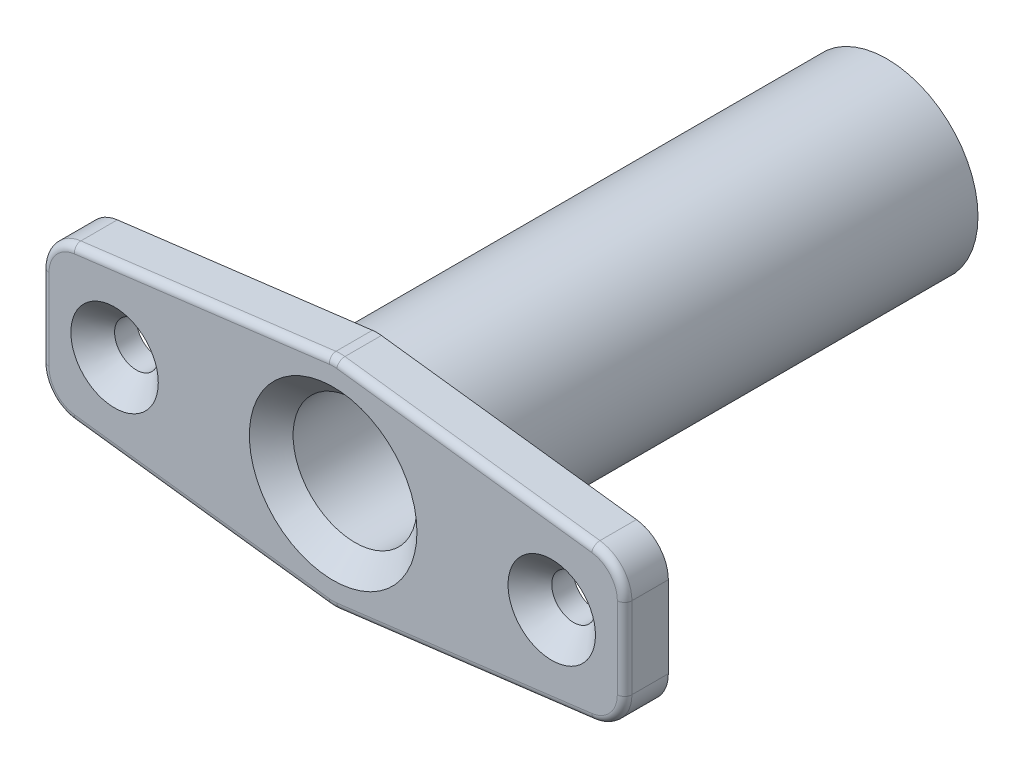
ISO-10303-21;
HEADER;
FILE_DESCRIPTION(('STEP AP214'),'2;1');
FILE_NAME('part.step','',(''),(''),'','','');
FILE_SCHEMA(('AUTOMOTIVE_DESIGN { 1 0 10303 214 1 1 1 1 }'));
ENDSEC;
DATA;
#1=APPLICATION_CONTEXT('core data for automotive mechanical design processes');
#2=APPLICATION_PROTOCOL_DEFINITION('international standard','automotive_design',2000,#1);
#3=PRODUCT_CONTEXT('',#1,'mechanical');
#4=PRODUCT('Part','Part','',(#3));
#5=PRODUCT_RELATED_PRODUCT_CATEGORY('part','',(#4));
#6=PRODUCT_DEFINITION_FORMATION('','',#4);
#7=PRODUCT_DEFINITION_CONTEXT('part definition',#1,'design');
#8=PRODUCT_DEFINITION('design','',#6,#7);
#9=PRODUCT_DEFINITION_SHAPE('','',#8);
#10=(LENGTH_UNIT() NAMED_UNIT(*) SI_UNIT(.MILLI.,.METRE.));
#11=(NAMED_UNIT(*) PLANE_ANGLE_UNIT() SI_UNIT($,.RADIAN.));
#12=(NAMED_UNIT(*) SI_UNIT($,.STERADIAN.) SOLID_ANGLE_UNIT());
#13=UNCERTAINTY_MEASURE_WITH_UNIT(LENGTH_MEASURE(1.E-05),#10,'distance_accuracy_value','');
#14=(GEOMETRIC_REPRESENTATION_CONTEXT(3) GLOBAL_UNCERTAINTY_ASSIGNED_CONTEXT((#13)) GLOBAL_UNIT_ASSIGNED_CONTEXT((#10,
#11,#12)) REPRESENTATION_CONTEXT('',''));
#15=CARTESIAN_POINT('',(0.,0.,0.));
#16=DIRECTION('',(0.,0.,1.));
#17=DIRECTION('',(1.,0.,0.));
#18=AXIS2_PLACEMENT_3D('',#15,#16,#17);
#19=CARTESIAN_POINT('',(0.,0.,4.));
#20=DIRECTION('',(0.,0.,1.));
#21=DIRECTION('',(1.,0.,0.));
#22=AXIS2_PLACEMENT_3D('',#19,#20,#21);
#23=PLANE('',#22);
#24=CARTESIAN_POINT('',(0.,0.,4.));
#25=DIRECTION('',(0.,0.,1.));
#26=DIRECTION('',(1.,0.,0.));
#27=AXIS2_PLACEMENT_3D('',#24,#25,#26);
#28=CIRCLE('',#27,8.5);
#29=CARTESIAN_POINT('',(8.5,0.,4.));
#30=VERTEX_POINT('',#29);
#31=EDGE_CURVE('E192',#30,#30,#28,.T.);
#32=ORIENTED_EDGE('',*,*,#31,.T.);
#33=EDGE_LOOP('',(#32));
#34=FACE_BOUND('',#33,.T.);
#35=ADVANCED_FACE('F24',(#34),#23,.T.);
#36=CARTESIAN_POINT('',(0.,0.,4.));
#37=DIRECTION('',(0.,0.,1.));
#38=DIRECTION('',(1.,0.,0.));
#39=AXIS2_PLACEMENT_3D('',#36,#37,#38);
#40=CYLINDRICAL_SURFACE('',#39,8.5);
#41=CARTESIAN_POINT('',(0.,0.,73.));
#42=DIRECTION('',(0.,0.,1.));
#43=DIRECTION('',(1.,0.,0.));
#44=AXIS2_PLACEMENT_3D('',#41,#42,#43);
#45=CIRCLE('',#44,8.5);
#46=CARTESIAN_POINT('',(8.5,0.,73.));
#47=VERTEX_POINT('',#46);
#48=EDGE_CURVE('E234',#47,#47,#45,.T.);
#49=ORIENTED_EDGE('',*,*,#48,.T.);
#50=EDGE_LOOP('',(#49));
#51=FACE_BOUND('',#50,.T.);
#52=ORIENTED_EDGE('',*,*,#31,.F.);
#53=EDGE_LOOP('',(#52));
#54=FACE_BOUND('',#53,.T.);
#55=ADVANCED_FACE('F375',(#51,#54),#40,.F.);
#56=CARTESIAN_POINT('',(0.,0.,70.));
#57=DIRECTION('',(0.,0.,-1.));
#58=DIRECTION('',(-1.,0.,0.));
#59=AXIS2_PLACEMENT_3D('',#56,#57,#58);
#60=CYLINDRICAL_SURFACE('',#59,12.5);
#61=CARTESIAN_POINT('',(0.,0.,70.));
#62=DIRECTION('',(0.,0.,1.));
#63=DIRECTION('',(1.,0.,0.));
#64=AXIS2_PLACEMENT_3D('',#61,#62,#63);
#65=CIRCLE('',#64,12.5);
#66=CARTESIAN_POINT('',(12.5,0.,70.));
#67=VERTEX_POINT('',#66);
#68=EDGE_CURVE('E198',#67,#67,#65,.T.);
#69=ORIENTED_EDGE('',*,*,#68,.F.);
#70=EDGE_LOOP('',(#69));
#71=FACE_BOUND('',#70,.T.);
#72=CARTESIAN_POINT('',(0.,0.,0.));
#73=DIRECTION('',(0.,0.,1.));
#74=DIRECTION('',(1.,0.,0.));
#75=AXIS2_PLACEMENT_3D('',#72,#73,#74);
#76=CIRCLE('',#75,12.5);
#77=CARTESIAN_POINT('',(12.5,0.,0.));
#78=VERTEX_POINT('',#77);
#79=EDGE_CURVE('E195',#78,#78,#76,.T.);
#80=ORIENTED_EDGE('',*,*,#79,.T.);
#81=EDGE_LOOP('',(#80));
#82=FACE_BOUND('',#81,.T.);
#83=ADVANCED_FACE('F26',(#71,#82),#60,.T.);
#84=CARTESIAN_POINT('',(0.,0.,0.));
#85=DIRECTION('',(0.,0.,1.));
#86=DIRECTION('',(1.,0.,0.));
#87=AXIS2_PLACEMENT_3D('',#84,#85,#86);
#88=PLANE('',#87);
#89=ORIENTED_EDGE('',*,*,#79,.F.);
#90=EDGE_LOOP('',(#89));
#91=FACE_BOUND('',#90,.T.);
#92=ADVANCED_FACE('F385',(#91),#88,.F.);
#93=CARTESIAN_POINT('',(40.,10.,70.));
#94=DIRECTION('',(0.,0.,1.));
#95=DIRECTION('',(1.,0.,0.));
#96=AXIS2_PLACEMENT_3D('',#93,#94,#95);
#97=PLANE('',#96);
#98=CARTESIAN_POINT('',(30.,0.,70.));
#99=DIRECTION('',(0.,0.,1.));
#100=DIRECTION('',(1.,0.,0.));
#101=AXIS2_PLACEMENT_3D('',#98,#99,#100);
#102=CIRCLE('',#101,3.);
#103=CARTESIAN_POINT('',(33.,0.,70.));
#104=VERTEX_POINT('',#103);
#105=EDGE_CURVE('E352',#104,#104,#102,.T.);
#106=ORIENTED_EDGE('',*,*,#105,.T.);
#107=EDGE_LOOP('',(#106));
#108=FACE_BOUND('',#107,.T.);
#109=CARTESIAN_POINT('',(-30.,0.,70.));
#110=DIRECTION('',(0.,0.,1.));
#111=DIRECTION('',(1.,0.,0.));
#112=AXIS2_PLACEMENT_3D('',#109,#110,#111);
#113=CIRCLE('',#112,3.);
#114=CARTESIAN_POINT('',(-27.,0.,70.));
#115=VERTEX_POINT('',#114);
#116=EDGE_CURVE('E181',#115,#115,#113,.T.);
#117=ORIENTED_EDGE('',*,*,#116,.T.);
#118=EDGE_LOOP('',(#117));
#119=FACE_BOUND('',#118,.T.);
#120=DIRECTION('',(0.992277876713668,0.124034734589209,0.));
#121=VECTOR('',#120,1.);
#122=CARTESIAN_POINT('',(0.,-15.,70.));
#123=LINE('',#122,#121);
#124=CARTESIAN_POINT('',(0.620173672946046,-14.9224782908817,70.));
#125=VERTEX_POINT('',#124);
#126=CARTESIAN_POINT('',(35.6201736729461,-10.5474782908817,70.));
#127=VERTEX_POINT('',#126);
#128=EDGE_CURVE('E176',#125,#127,#123,.T.);
#129=ORIENTED_EDGE('',*,*,#128,.F.);
#130=CARTESIAN_POINT('',(0.,-9.96108890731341,70.));
#131=DIRECTION('',(0.,0.,1.));
#132=DIRECTION('',(1.,0.,0.));
#133=AXIS2_PLACEMENT_3D('',#130,#131,#132);
#134=CIRCLE('',#133,5.);
#135=CARTESIAN_POINT('',(-0.620173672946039,-14.9224782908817,70.));
#136=VERTEX_POINT('',#135);
#137=EDGE_CURVE('E229',#125,#136,#134,.F.);
#138=ORIENTED_EDGE('',*,*,#137,.T.);
#139=DIRECTION('',(-0.992277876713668,0.124034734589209,0.));
#140=VECTOR('',#139,1.);
#141=CARTESIAN_POINT('',(0.,-15.,70.));
#142=LINE('',#141,#140);
#143=CARTESIAN_POINT('',(-35.6201736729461,-10.5474782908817,70.));
#144=VERTEX_POINT('',#143);
#145=EDGE_CURVE('E179',#136,#144,#142,.T.);
#146=ORIENTED_EDGE('',*,*,#145,.T.);
#147=CARTESIAN_POINT('',(-35.,-5.58608890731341,70.));
#148=DIRECTION('',(0.,0.,1.));
#149=DIRECTION('',(1.,0.,0.));
#150=AXIS2_PLACEMENT_3D('',#147,#148,#149);
#151=CIRCLE('',#150,5.);
#152=CARTESIAN_POINT('',(-40.,-5.58608890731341,70.));
#153=VERTEX_POINT('',#152);
#154=EDGE_CURVE('E210',#144,#153,#151,.F.);
#155=ORIENTED_EDGE('',*,*,#154,.T.);
#156=DIRECTION('',(0.,-1.,0.));
#157=VECTOR('',#156,1.);
#158=CARTESIAN_POINT('',(-40.,10.,70.));
#159=LINE('',#158,#157);
#160=CARTESIAN_POINT('',(-40.,5.58608890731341,70.));
#161=VERTEX_POINT('',#160);
#162=EDGE_CURVE('E187',#161,#153,#159,.T.);
#163=ORIENTED_EDGE('',*,*,#162,.F.);
#164=CARTESIAN_POINT('',(-35.,5.58608890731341,70.));
#165=DIRECTION('',(0.,0.,1.));
#166=DIRECTION('',(1.,0.,0.));
#167=AXIS2_PLACEMENT_3D('',#164,#165,#166);
#168=CIRCLE('',#167,5.);
#169=CARTESIAN_POINT('',(-35.6201736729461,10.5474782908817,70.));
#170=VERTEX_POINT('',#169);
#171=EDGE_CURVE('E212',#161,#170,#168,.F.);
#172=ORIENTED_EDGE('',*,*,#171,.T.);
#173=DIRECTION('',(-0.992277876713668,-0.124034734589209,0.));
#174=VECTOR('',#173,1.);
#175=CARTESIAN_POINT('',(0.,15.,70.));
#176=LINE('',#175,#174);
#177=CARTESIAN_POINT('',(-0.62017367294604,14.9224782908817,70.));
#178=VERTEX_POINT('',#177);
#179=EDGE_CURVE('E190',#178,#170,#176,.T.);
#180=ORIENTED_EDGE('',*,*,#179,.F.);
#181=CARTESIAN_POINT('',(0.,9.96108890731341,70.));
#182=DIRECTION('',(0.,0.,1.));
#183=DIRECTION('',(1.,0.,0.));
#184=AXIS2_PLACEMENT_3D('',#181,#182,#183);
#185=CIRCLE('',#184,5.);
#186=CARTESIAN_POINT('',(0.620173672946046,14.9224782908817,70.));
#187=VERTEX_POINT('',#186);
#188=EDGE_CURVE('E222',#178,#187,#185,.F.);
#189=ORIENTED_EDGE('',*,*,#188,.T.);
#190=DIRECTION('',(0.992277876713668,-0.124034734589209,0.));
#191=VECTOR('',#190,1.);
#192=CARTESIAN_POINT('',(0.,15.,70.));
#193=LINE('',#192,#191);
#194=CARTESIAN_POINT('',(35.6201736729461,10.5474782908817,70.));
#195=VERTEX_POINT('',#194);
#196=EDGE_CURVE('E177',#187,#195,#193,.T.);
#197=ORIENTED_EDGE('',*,*,#196,.T.);
#198=CARTESIAN_POINT('',(35.,5.58608890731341,70.));
#199=DIRECTION('',(0.,0.,1.));
#200=DIRECTION('',(1.,0.,0.));
#201=AXIS2_PLACEMENT_3D('',#198,#199,#200);
#202=CIRCLE('',#201,5.);
#203=CARTESIAN_POINT('',(40.,5.58608890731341,70.));
#204=VERTEX_POINT('',#203);
#205=EDGE_CURVE('E160',#195,#204,#202,.F.);
#206=ORIENTED_EDGE('',*,*,#205,.T.);
#207=DIRECTION('',(0.,1.,0.));
#208=VECTOR('',#207,1.);
#209=CARTESIAN_POINT('',(40.,-10.,70.));
#210=LINE('',#209,#208);
#211=CARTESIAN_POINT('',(40.,-5.58608890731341,70.));
#212=VERTEX_POINT('',#211);
#213=EDGE_CURVE('E154',#212,#204,#210,.T.);
#214=ORIENTED_EDGE('',*,*,#213,.F.);
#215=CARTESIAN_POINT('',(35.,-5.58608890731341,70.));
#216=DIRECTION('',(0.,0.,1.));
#217=DIRECTION('',(1.,0.,0.));
#218=AXIS2_PLACEMENT_3D('',#215,#216,#217);
#219=CIRCLE('',#218,5.);
#220=EDGE_CURVE('E165',#212,#127,#219,.F.);
#221=ORIENTED_EDGE('',*,*,#220,.T.);
#222=EDGE_LOOP('',(#129,#138,#146,#155,#163,#172,#180,#189,#197,#206,#214,#221));
#223=FACE_BOUND('',#222,.T.);
#224=ORIENTED_EDGE('',*,*,#68,.T.);
#225=EDGE_LOOP('',(#224));
#226=FACE_BOUND('',#225,.T.);
#227=ADVANCED_FACE('F172',(#108,#119,#223,#226),#97,.F.);
#228=CARTESIAN_POINT('',(0.,15.,76.));
#229=DIRECTION('',(0.124034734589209,0.992277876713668,0.));
#230=DIRECTION('',(-0.992277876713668,0.124034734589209,0.));
#231=AXIS2_PLACEMENT_3D('',#228,#229,#230);
#232=PLANE('',#231);
#233=DIRECTION('',(0.,0.,-1.));
#234=VECTOR('',#233,1.);
#235=CARTESIAN_POINT('',(0.620173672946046,14.9224782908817,76.));
#236=LINE('',#235,#234);
#237=CARTESIAN_POINT('',(0.620173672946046,14.9224782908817,75.));
#238=VERTEX_POINT('',#237);
#239=EDGE_CURVE('E224',#187,#238,#236,.F.);
#240=ORIENTED_EDGE('',*,*,#239,.T.);
#241=DIRECTION('',(0.992277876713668,-0.124034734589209,0.));
#242=VECTOR('',#241,1.);
#243=CARTESIAN_POINT('',(0.,15.,75.));
#244=LINE('',#243,#242);
#245=CARTESIAN_POINT('',(35.620173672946,10.5474782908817,75.));
#246=VERTEX_POINT('',#245);
#247=EDGE_CURVE('E284',#238,#246,#244,.T.);
#248=ORIENTED_EDGE('',*,*,#247,.T.);
#249=DIRECTION('',(0.,0.,-1.));
#250=VECTOR('',#249,1.);
#251=CARTESIAN_POINT('',(35.620173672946,10.5474782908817,76.));
#252=LINE('',#251,#250);
#253=EDGE_CURVE('E204',#246,#195,#252,.T.);
#254=ORIENTED_EDGE('',*,*,#253,.T.);
#255=ORIENTED_EDGE('',*,*,#196,.F.);
#256=EDGE_LOOP('',(#240,#248,#254,#255));
#257=FACE_BOUND('',#256,.T.);
#258=ADVANCED_FACE('F392',(#257),#232,.T.);
#259=CARTESIAN_POINT('',(0.,15.,76.));
#260=DIRECTION('',(0.124034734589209,-0.992277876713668,0.));
#261=DIRECTION('',(0.992277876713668,0.124034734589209,0.));
#262=AXIS2_PLACEMENT_3D('',#259,#260,#261);
#263=PLANE('',#262);
#264=DIRECTION('',(0.,0.,-1.));
#265=VECTOR('',#264,1.);
#266=CARTESIAN_POINT('',(-35.6201736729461,10.5474782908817,76.));
#267=LINE('',#266,#265);
#268=CARTESIAN_POINT('',(-35.6201736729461,10.5474782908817,75.));
#269=VERTEX_POINT('',#268);
#270=EDGE_CURVE('E215',#170,#269,#267,.F.);
#271=ORIENTED_EDGE('',*,*,#270,.T.);
#272=DIRECTION('',(-0.992277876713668,-0.124034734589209,0.));
#273=VECTOR('',#272,1.);
#274=CARTESIAN_POINT('',(38.7692307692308,19.8461538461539,75.));
#275=LINE('',#274,#273);
#276=CARTESIAN_POINT('',(-0.62017367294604,14.9224782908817,75.));
#277=VERTEX_POINT('',#276);
#278=EDGE_CURVE('E282',#269,#277,#275,.F.);
#279=ORIENTED_EDGE('',*,*,#278,.T.);
#280=DIRECTION('',(0.,0.,-1.));
#281=VECTOR('',#280,1.);
#282=CARTESIAN_POINT('',(-0.62017367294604,14.9224782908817,76.));
#283=LINE('',#282,#281);
#284=EDGE_CURVE('E220',#277,#178,#283,.T.);
#285=ORIENTED_EDGE('',*,*,#284,.T.);
#286=ORIENTED_EDGE('',*,*,#179,.T.);
#287=EDGE_LOOP('',(#271,#279,#285,#286));
#288=FACE_BOUND('',#287,.T.);
#289=ADVANCED_FACE('F305',(#288),#263,.F.);
#290=CARTESIAN_POINT('',(-40.,10.,76.));
#291=DIRECTION('',(1.,0.,0.));
#292=DIRECTION('',(0.,0.,-1.));
#293=AXIS2_PLACEMENT_3D('',#290,#291,#292);
#294=PLANE('',#293);
#295=DIRECTION('',(0.,0.,-1.));
#296=VECTOR('',#295,1.);
#297=CARTESIAN_POINT('',(-40.,-5.58608890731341,76.));
#298=LINE('',#297,#296);
#299=CARTESIAN_POINT('',(-40.,-5.58608890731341,75.));
#300=VERTEX_POINT('',#299);
#301=EDGE_CURVE('E206',#153,#300,#298,.F.);
#302=ORIENTED_EDGE('',*,*,#301,.T.);
#303=DIRECTION('',(0.,-1.,0.));
#304=VECTOR('',#303,1.);
#305=CARTESIAN_POINT('',(-40.,10.,75.));
#306=LINE('',#305,#304);
#307=CARTESIAN_POINT('',(-40.,5.58608890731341,75.));
#308=VERTEX_POINT('',#307);
#309=EDGE_CURVE('E45',#300,#308,#306,.F.);
#310=ORIENTED_EDGE('',*,*,#309,.T.);
#311=DIRECTION('',(0.,0.,-1.));
#312=VECTOR('',#311,1.);
#313=CARTESIAN_POINT('',(-40.,5.58608890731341,76.));
#314=LINE('',#313,#312);
#315=EDGE_CURVE('E208',#308,#161,#314,.T.);
#316=ORIENTED_EDGE('',*,*,#315,.T.);
#317=ORIENTED_EDGE('',*,*,#162,.T.);
#318=EDGE_LOOP('',(#302,#310,#316,#317));
#319=FACE_BOUND('',#318,.T.);
#320=ADVANCED_FACE('F611',(#319),#294,.F.);
#321=CARTESIAN_POINT('',(0.,-15.,76.));
#322=DIRECTION('',(-0.124034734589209,-0.992277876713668,0.));
#323=DIRECTION('',(0.992277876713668,-0.124034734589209,0.));
#324=AXIS2_PLACEMENT_3D('',#321,#322,#323);
#325=PLANE('',#324);
#326=DIRECTION('',(0.,0.,-1.));
#327=VECTOR('',#326,1.);
#328=CARTESIAN_POINT('',(-0.620173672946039,-14.9224782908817,76.));
#329=LINE('',#328,#327);
#330=CARTESIAN_POINT('',(-0.620173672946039,-14.9224782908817,75.));
#331=VERTEX_POINT('',#330);
#332=EDGE_CURVE('E231',#136,#331,#329,.F.);
#333=ORIENTED_EDGE('',*,*,#332,.T.);
#334=DIRECTION('',(-0.992277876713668,0.124034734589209,0.));
#335=VECTOR('',#334,1.);
#336=CARTESIAN_POINT('',(0.,-15.,75.));
#337=LINE('',#336,#335);
#338=CARTESIAN_POINT('',(-35.620173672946,-10.5474782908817,75.));
#339=VERTEX_POINT('',#338);
#340=EDGE_CURVE('E289',#331,#339,#337,.T.);
#341=ORIENTED_EDGE('',*,*,#340,.T.);
#342=DIRECTION('',(0.,0.,-1.));
#343=VECTOR('',#342,1.);
#344=CARTESIAN_POINT('',(-35.620173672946,-10.5474782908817,76.));
#345=LINE('',#344,#343);
#346=EDGE_CURVE('E218',#339,#144,#345,.T.);
#347=ORIENTED_EDGE('',*,*,#346,.T.);
#348=ORIENTED_EDGE('',*,*,#145,.F.);
#349=EDGE_LOOP('',(#333,#341,#347,#348));
#350=FACE_BOUND('',#349,.T.);
#351=ADVANCED_FACE('F606',(#350),#325,.T.);
#352=CARTESIAN_POINT('',(0.,-15.,76.));
#353=DIRECTION('',(-0.124034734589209,0.992277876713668,0.));
#354=DIRECTION('',(-0.992277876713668,-0.124034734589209,0.));
#355=AXIS2_PLACEMENT_3D('',#352,#353,#354);
#356=PLANE('',#355);
#357=DIRECTION('',(0.,0.,-1.));
#358=VECTOR('',#357,1.);
#359=CARTESIAN_POINT('',(35.6201736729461,-10.5474782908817,76.));
#360=LINE('',#359,#358);
#361=CARTESIAN_POINT('',(35.6201736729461,-10.5474782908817,75.));
#362=VERTEX_POINT('',#361);
#363=EDGE_CURVE('E168',#127,#362,#360,.F.);
#364=ORIENTED_EDGE('',*,*,#363,.T.);
#365=DIRECTION('',(0.992277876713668,0.124034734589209,0.));
#366=VECTOR('',#365,1.);
#367=CARTESIAN_POINT('',(42.4615384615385,-9.69230769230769,75.));
#368=LINE('',#367,#366);
#369=CARTESIAN_POINT('',(0.620173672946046,-14.9224782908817,75.));
#370=VERTEX_POINT('',#369);
#371=EDGE_CURVE('E287',#362,#370,#368,.F.);
#372=ORIENTED_EDGE('',*,*,#371,.T.);
#373=DIRECTION('',(0.,0.,-1.));
#374=VECTOR('',#373,1.);
#375=CARTESIAN_POINT('',(0.620173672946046,-14.9224782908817,76.));
#376=LINE('',#375,#374);
#377=EDGE_CURVE('E227',#370,#125,#376,.T.);
#378=ORIENTED_EDGE('',*,*,#377,.T.);
#379=ORIENTED_EDGE('',*,*,#128,.T.);
#380=EDGE_LOOP('',(#364,#372,#378,#379));
#381=FACE_BOUND('',#380,.T.);
#382=ADVANCED_FACE('F595',(#381),#356,.F.);
#383=CARTESIAN_POINT('',(40.,-10.,76.));
#384=DIRECTION('',(-1.,0.,0.));
#385=DIRECTION('',(0.,0.,1.));
#386=AXIS2_PLACEMENT_3D('',#383,#384,#385);
#387=PLANE('',#386);
#388=DIRECTION('',(0.,0.,-1.));
#389=VECTOR('',#388,1.);
#390=CARTESIAN_POINT('',(40.,5.58608890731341,76.));
#391=LINE('',#390,#389);
#392=CARTESIAN_POINT('',(40.,5.58608890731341,75.));
#393=VERTEX_POINT('',#392);
#394=EDGE_CURVE('E161',#204,#393,#391,.F.);
#395=ORIENTED_EDGE('',*,*,#394,.T.);
#396=DIRECTION('',(0.,1.,0.));
#397=VECTOR('',#396,1.);
#398=CARTESIAN_POINT('',(40.,10.,75.));
#399=LINE('',#398,#397);
#400=CARTESIAN_POINT('',(40.,-5.58608890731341,75.));
#401=VERTEX_POINT('',#400);
#402=EDGE_CURVE('E157',#393,#401,#399,.F.);
#403=ORIENTED_EDGE('',*,*,#402,.T.);
#404=DIRECTION('',(0.,0.,-1.));
#405=VECTOR('',#404,1.);
#406=CARTESIAN_POINT('',(40.,-5.58608890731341,76.));
#407=LINE('',#406,#405);
#408=EDGE_CURVE('E149',#401,#212,#407,.T.);
#409=ORIENTED_EDGE('',*,*,#408,.T.);
#410=ORIENTED_EDGE('',*,*,#213,.T.);
#411=EDGE_LOOP('',(#395,#403,#409,#410));
#412=FACE_BOUND('',#411,.T.);
#413=ADVANCED_FACE('F152',(#412),#387,.F.);
#414=CARTESIAN_POINT('',(40.,10.,76.));
#415=DIRECTION('',(0.,0.,1.));
#416=DIRECTION('',(1.,0.,0.));
#417=AXIS2_PLACEMENT_3D('',#414,#415,#416);
#418=PLANE('',#417);
#419=CARTESIAN_POINT('',(0.,9.96108890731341,76.));
#420=DIRECTION('',(0.,0.,1.));
#421=DIRECTION('',(1.,0.,0.));
#422=AXIS2_PLACEMENT_3D('',#419,#420,#421);
#423=CIRCLE('',#422,4.);
#424=CARTESIAN_POINT('',(0.496138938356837,13.9302004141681,76.));
#425=VERTEX_POINT('',#424);
#426=CARTESIAN_POINT('',(-0.496138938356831,13.9302004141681,76.));
#427=VERTEX_POINT('',#426);
#428=EDGE_CURVE('E266',#425,#427,#423,.T.);
#429=ORIENTED_EDGE('',*,*,#428,.T.);
#430=DIRECTION('',(-0.992277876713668,-0.124034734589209,0.));
#431=VECTOR('',#430,1.);
#432=CARTESIAN_POINT('',(38.89326550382,18.8538759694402,76.));
#433=LINE('',#432,#431);
#434=CARTESIAN_POINT('',(-35.4961389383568,9.55520041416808,76.));
#435=VERTEX_POINT('',#434);
#436=EDGE_CURVE('E275',#427,#435,#433,.T.);
#437=ORIENTED_EDGE('',*,*,#436,.T.);
#438=CARTESIAN_POINT('',(-35.,5.58608890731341,76.));
#439=DIRECTION('',(0.,0.,1.));
#440=DIRECTION('',(1.,0.,0.));
#441=AXIS2_PLACEMENT_3D('',#438,#439,#440);
#442=CIRCLE('',#441,4.);
#443=CARTESIAN_POINT('',(-39.,5.58608890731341,76.));
#444=VERTEX_POINT('',#443);
#445=EDGE_CURVE('E273',#435,#444,#442,.T.);
#446=ORIENTED_EDGE('',*,*,#445,.T.);
#447=DIRECTION('',(0.,-1.,0.));
#448=VECTOR('',#447,1.);
#449=CARTESIAN_POINT('',(-39.,10.,76.));
#450=LINE('',#449,#448);
#451=CARTESIAN_POINT('',(-39.,-5.58608890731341,76.));
#452=VERTEX_POINT('',#451);
#453=EDGE_CURVE('E271',#444,#452,#450,.T.);
#454=ORIENTED_EDGE('',*,*,#453,.T.);
#455=CARTESIAN_POINT('',(-35.,-5.58608890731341,76.));
#456=DIRECTION('',(0.,0.,1.));
#457=DIRECTION('',(1.,0.,0.));
#458=AXIS2_PLACEMENT_3D('',#455,#456,#457);
#459=CIRCLE('',#458,4.);
#460=CARTESIAN_POINT('',(-35.4961389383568,-9.55520041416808,76.));
#461=VERTEX_POINT('',#460);
#462=EDGE_CURVE('E269',#452,#461,#459,.T.);
#463=ORIENTED_EDGE('',*,*,#462,.T.);
#464=DIRECTION('',(-0.992277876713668,0.124034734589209,0.));
#465=VECTOR('',#464,1.);
#466=CARTESIAN_POINT('',(36.4317270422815,-18.5461836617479,76.));
#467=LINE('',#466,#465);
#468=CARTESIAN_POINT('',(-0.496138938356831,-13.9302004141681,76.));
#469=VERTEX_POINT('',#468);
#470=EDGE_CURVE('E262',#461,#469,#467,.F.);
#471=ORIENTED_EDGE('',*,*,#470,.T.);
#472=CARTESIAN_POINT('',(0.,-9.96108890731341,76.));
#473=DIRECTION('',(0.,0.,1.));
#474=DIRECTION('',(1.,0.,0.));
#475=AXIS2_PLACEMENT_3D('',#472,#473,#474);
#476=CIRCLE('',#475,4.);
#477=CARTESIAN_POINT('',(0.496138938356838,-13.9302004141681,76.));
#478=VERTEX_POINT('',#477);
#479=EDGE_CURVE('E258',#469,#478,#476,.T.);
#480=ORIENTED_EDGE('',*,*,#479,.T.);
#481=DIRECTION('',(0.992277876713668,0.124034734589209,0.));
#482=VECTOR('',#481,1.);
#483=CARTESIAN_POINT('',(42.3375037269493,-8.70002981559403,76.));
#484=LINE('',#483,#482);
#485=CARTESIAN_POINT('',(35.4961389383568,-9.55520041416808,76.));
#486=VERTEX_POINT('',#485);
#487=EDGE_CURVE('E254',#478,#486,#484,.T.);
#488=ORIENTED_EDGE('',*,*,#487,.T.);
#489=CARTESIAN_POINT('',(35.,-5.58608890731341,76.));
#490=DIRECTION('',(0.,0.,1.));
#491=DIRECTION('',(1.,0.,0.));
#492=AXIS2_PLACEMENT_3D('',#489,#490,#491);
#493=CIRCLE('',#492,4.);
#494=CARTESIAN_POINT('',(39.,-5.58608890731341,76.));
#495=VERTEX_POINT('',#494);
#496=EDGE_CURVE('E252',#486,#495,#493,.T.);
#497=ORIENTED_EDGE('',*,*,#496,.T.);
#498=DIRECTION('',(0.,1.,0.));
#499=VECTOR('',#498,1.);
#500=CARTESIAN_POINT('',(39.,10.,76.));
#501=LINE('',#500,#499);
#502=CARTESIAN_POINT('',(39.,5.58608890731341,76.));
#503=VERTEX_POINT('',#502);
#504=EDGE_CURVE('E256',#495,#503,#501,.T.);
#505=ORIENTED_EDGE('',*,*,#504,.T.);
#506=CARTESIAN_POINT('',(35.,5.58608890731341,76.));
#507=DIRECTION('',(0.,0.,1.));
#508=DIRECTION('',(1.,0.,0.));
#509=AXIS2_PLACEMENT_3D('',#506,#507,#508);
#510=CIRCLE('',#509,4.);
#511=CARTESIAN_POINT('',(35.4961389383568,9.55520041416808,76.));
#512=VERTEX_POINT('',#511);
#513=EDGE_CURVE('E260',#503,#512,#510,.T.);
#514=ORIENTED_EDGE('',*,*,#513,.T.);
#515=DIRECTION('',(0.992277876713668,-0.124034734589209,0.));
#516=VECTOR('',#515,1.);
#517=CARTESIAN_POINT('',(39.8759652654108,9.00772212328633,76.));
#518=LINE('',#517,#516);
#519=EDGE_CURVE('E264',#512,#425,#518,.F.);
#520=ORIENTED_EDGE('',*,*,#519,.T.);
#521=EDGE_LOOP('',(#429,#437,#446,#454,#463,#471,#480,#488,#497,#505,#514,#520));
#522=FACE_BOUND('',#521,.T.);
#523=CARTESIAN_POINT('',(30.,0.,76.));
#524=DIRECTION('',(0.,0.,1.));
#525=DIRECTION('',(1.,0.,0.));
#526=AXIS2_PLACEMENT_3D('',#523,#524,#525);
#527=CIRCLE('',#526,6.00000000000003);
#528=CARTESIAN_POINT('',(36.,0.,76.));
#529=VERTEX_POINT('',#528);
#530=EDGE_CURVE('E246',#529,#529,#527,.F.);
#531=ORIENTED_EDGE('',*,*,#530,.T.);
#532=EDGE_LOOP('',(#531));
#533=FACE_BOUND('',#532,.T.);
#534=CARTESIAN_POINT('',(-30.,0.,76.));
#535=DIRECTION('',(0.,0.,1.));
#536=DIRECTION('',(1.,0.,0.));
#537=AXIS2_PLACEMENT_3D('',#534,#535,#536);
#538=CIRCLE('',#537,6.00000000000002);
#539=CARTESIAN_POINT('',(-24.,0.,76.));
#540=VERTEX_POINT('',#539);
#541=EDGE_CURVE('E243',#540,#540,#538,.F.);
#542=ORIENTED_EDGE('',*,*,#541,.T.);
#543=EDGE_LOOP('',(#542));
#544=FACE_BOUND('',#543,.T.);
#545=CARTESIAN_POINT('',(0.,0.,76.));
#546=DIRECTION('',(0.,0.,1.));
#547=DIRECTION('',(1.,0.,0.));
#548=AXIS2_PLACEMENT_3D('',#545,#546,#547);
#549=CIRCLE('',#548,11.5);
#550=CARTESIAN_POINT('',(11.5,0.,76.));
#551=VERTEX_POINT('',#550);
#552=EDGE_CURVE('E237',#551,#551,#549,.F.);
#553=ORIENTED_EDGE('',*,*,#552,.T.);
#554=EDGE_LOOP('',(#553));
#555=FACE_BOUND('',#554,.T.);
#556=ADVANCED_FACE('F412',(#522,#533,#544,#555),#418,.T.);
#557=CARTESIAN_POINT('',(35.,-5.58608890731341,76.));
#558=DIRECTION('',(0.,0.,-1.));
#559=DIRECTION('',(-1.,0.,0.));
#560=AXIS2_PLACEMENT_3D('',#557,#558,#559);
#561=CYLINDRICAL_SURFACE('',#560,5.);
#562=ORIENTED_EDGE('',*,*,#408,.F.);
#563=CARTESIAN_POINT('',(35.,-5.58608890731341,75.));
#564=DIRECTION('',(0.,0.,1.));
#565=DIRECTION('',(1.,0.,0.));
#566=AXIS2_PLACEMENT_3D('',#563,#564,#565);
#567=CIRCLE('',#566,5.);
#568=EDGE_CURVE('E11',#401,#362,#567,.F.);
#569=ORIENTED_EDGE('',*,*,#568,.T.);
#570=ORIENTED_EDGE('',*,*,#363,.F.);
#571=ORIENTED_EDGE('',*,*,#220,.F.);
#572=EDGE_LOOP('',(#562,#569,#570,#571));
#573=FACE_BOUND('',#572,.T.);
#574=ADVANCED_FACE('F166',(#573),#561,.T.);
#575=CARTESIAN_POINT('',(35.,5.58608890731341,76.));
#576=DIRECTION('',(0.,0.,1.));
#577=DIRECTION('',(1.,0.,0.));
#578=AXIS2_PLACEMENT_3D('',#575,#576,#577);
#579=CYLINDRICAL_SURFACE('',#578,5.);
#580=ORIENTED_EDGE('',*,*,#253,.F.);
#581=CARTESIAN_POINT('',(35.,5.58608890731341,75.));
#582=DIRECTION('',(0.,0.,1.));
#583=DIRECTION('',(1.,0.,0.));
#584=AXIS2_PLACEMENT_3D('',#581,#582,#583);
#585=CIRCLE('',#584,5.);
#586=EDGE_CURVE('E291',#246,#393,#585,.F.);
#587=ORIENTED_EDGE('',*,*,#586,.T.);
#588=ORIENTED_EDGE('',*,*,#394,.F.);
#589=ORIENTED_EDGE('',*,*,#205,.F.);
#590=EDGE_LOOP('',(#580,#587,#588,#589));
#591=FACE_BOUND('',#590,.T.);
#592=ADVANCED_FACE('F421',(#591),#579,.T.);
#593=CARTESIAN_POINT('',(-35.,5.58608890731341,76.));
#594=DIRECTION('',(0.,0.,-1.));
#595=DIRECTION('',(-1.,0.,0.));
#596=AXIS2_PLACEMENT_3D('',#593,#594,#595);
#597=CYLINDRICAL_SURFACE('',#596,5.);
#598=ORIENTED_EDGE('',*,*,#315,.F.);
#599=CARTESIAN_POINT('',(-35.,5.58608890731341,75.));
#600=DIRECTION('',(0.,0.,1.));
#601=DIRECTION('',(1.,0.,0.));
#602=AXIS2_PLACEMENT_3D('',#599,#600,#601);
#603=CIRCLE('',#602,5.);
#604=EDGE_CURVE('E293',#308,#269,#603,.F.);
#605=ORIENTED_EDGE('',*,*,#604,.T.);
#606=ORIENTED_EDGE('',*,*,#270,.F.);
#607=ORIENTED_EDGE('',*,*,#171,.F.);
#608=EDGE_LOOP('',(#598,#605,#606,#607));
#609=FACE_BOUND('',#608,.T.);
#610=ADVANCED_FACE('F298',(#609),#597,.T.);
#611=CARTESIAN_POINT('',(-35.,-5.58608890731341,76.));
#612=DIRECTION('',(0.,0.,1.));
#613=DIRECTION('',(1.,0.,0.));
#614=AXIS2_PLACEMENT_3D('',#611,#612,#613);
#615=CYLINDRICAL_SURFACE('',#614,5.);
#616=ORIENTED_EDGE('',*,*,#346,.F.);
#617=CARTESIAN_POINT('',(-35.,-5.58608890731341,75.));
#618=DIRECTION('',(0.,0.,1.));
#619=DIRECTION('',(1.,0.,0.));
#620=AXIS2_PLACEMENT_3D('',#617,#618,#619);
#621=CIRCLE('',#620,5.);
#622=EDGE_CURVE('E32',#339,#300,#621,.F.);
#623=ORIENTED_EDGE('',*,*,#622,.T.);
#624=ORIENTED_EDGE('',*,*,#301,.F.);
#625=ORIENTED_EDGE('',*,*,#154,.F.);
#626=EDGE_LOOP('',(#616,#623,#624,#625));
#627=FACE_BOUND('',#626,.T.);
#628=ADVANCED_FACE('F435',(#627),#615,.T.);
#629=CARTESIAN_POINT('',(0.,9.96108890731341,76.));
#630=DIRECTION('',(0.,0.,1.));
#631=DIRECTION('',(1.,0.,0.));
#632=AXIS2_PLACEMENT_3D('',#629,#630,#631);
#633=CYLINDRICAL_SURFACE('',#632,5.);
#634=ORIENTED_EDGE('',*,*,#284,.F.);
#635=CARTESIAN_POINT('',(0.,9.96108890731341,75.));
#636=DIRECTION('',(0.,0.,1.));
#637=DIRECTION('',(1.,0.,0.));
#638=AXIS2_PLACEMENT_3D('',#635,#636,#637);
#639=CIRCLE('',#638,5.);
#640=EDGE_CURVE('E277',#277,#238,#639,.F.);
#641=ORIENTED_EDGE('',*,*,#640,.T.);
#642=ORIENTED_EDGE('',*,*,#239,.F.);
#643=ORIENTED_EDGE('',*,*,#188,.F.);
#644=EDGE_LOOP('',(#634,#641,#642,#643));
#645=FACE_BOUND('',#644,.T.);
#646=ADVANCED_FACE('F442',(#645),#633,.T.);
#647=CARTESIAN_POINT('',(0.,-9.96108890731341,76.));
#648=DIRECTION('',(0.,0.,1.));
#649=DIRECTION('',(1.,0.,0.));
#650=AXIS2_PLACEMENT_3D('',#647,#648,#649);
#651=CYLINDRICAL_SURFACE('',#650,5.);
#652=ORIENTED_EDGE('',*,*,#377,.F.);
#653=CARTESIAN_POINT('',(0.,-9.96108890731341,75.));
#654=DIRECTION('',(0.,0.,1.));
#655=DIRECTION('',(1.,0.,0.));
#656=AXIS2_PLACEMENT_3D('',#653,#654,#655);
#657=CIRCLE('',#656,5.);
#658=EDGE_CURVE('E280',#370,#331,#657,.F.);
#659=ORIENTED_EDGE('',*,*,#658,.T.);
#660=ORIENTED_EDGE('',*,*,#332,.F.);
#661=ORIENTED_EDGE('',*,*,#137,.F.);
#662=EDGE_LOOP('',(#652,#659,#660,#661));
#663=FACE_BOUND('',#662,.T.);
#664=ADVANCED_FACE('F371',(#663),#651,.T.);
#665=CARTESIAN_POINT('',(0.,0.,73.));
#666=DIRECTION('',(0.,0.,1.));
#667=DIRECTION('',(1.,0.,0.));
#668=AXIS2_PLACEMENT_3D('',#665,#666,#667);
#669=CONICAL_SURFACE('',#668,8.5,0.785398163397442);
#670=ORIENTED_EDGE('',*,*,#552,.F.);
#671=EDGE_LOOP('',(#670));
#672=FACE_BOUND('',#671,.T.);
#673=ORIENTED_EDGE('',*,*,#48,.F.);
#674=EDGE_LOOP('',(#673));
#675=FACE_BOUND('',#674,.T.);
#676=ADVANCED_FACE('F361',(#672,#675),#669,.F.);
#677=CARTESIAN_POINT('',(-30.,0.,70.));
#678=DIRECTION('',(0.,0.,1.));
#679=DIRECTION('',(1.,0.,0.));
#680=AXIS2_PLACEMENT_3D('',#677,#678,#679);
#681=CYLINDRICAL_SURFACE('',#680,3.);
#682=CARTESIAN_POINT('',(-30.,0.,73.));
#683=DIRECTION('',(0.,0.,1.));
#684=DIRECTION('',(1.,0.,0.));
#685=AXIS2_PLACEMENT_3D('',#682,#683,#684);
#686=CIRCLE('',#685,3.);
#687=CARTESIAN_POINT('',(-27.,0.,73.));
#688=VERTEX_POINT('',#687);
#689=EDGE_CURVE('E249',#688,#688,#686,.T.);
#690=ORIENTED_EDGE('',*,*,#689,.T.);
#691=EDGE_LOOP('',(#690));
#692=FACE_BOUND('',#691,.T.);
#693=ORIENTED_EDGE('',*,*,#116,.F.);
#694=EDGE_LOOP('',(#693));
#695=FACE_BOUND('',#694,.T.);
#696=ADVANCED_FACE('F358',(#692,#695),#681,.F.);
#697=CARTESIAN_POINT('',(30.,0.,70.));
#698=DIRECTION('',(0.,0.,1.));
#699=DIRECTION('',(1.,0.,0.));
#700=AXIS2_PLACEMENT_3D('',#697,#698,#699);
#701=CYLINDRICAL_SURFACE('',#700,3.);
#702=CARTESIAN_POINT('',(30.,0.,73.));
#703=DIRECTION('',(0.,0.,1.));
#704=DIRECTION('',(1.,0.,0.));
#705=AXIS2_PLACEMENT_3D('',#702,#703,#704);
#706=CIRCLE('',#705,3.);
#707=CARTESIAN_POINT('',(33.,0.,73.));
#708=VERTEX_POINT('',#707);
#709=EDGE_CURVE('E240',#708,#708,#706,.T.);
#710=ORIENTED_EDGE('',*,*,#709,.T.);
#711=EDGE_LOOP('',(#710));
#712=FACE_BOUND('',#711,.T.);
#713=ORIENTED_EDGE('',*,*,#105,.F.);
#714=EDGE_LOOP('',(#713));
#715=FACE_BOUND('',#714,.T.);
#716=ADVANCED_FACE('F360',(#712,#715),#701,.F.);
#717=CARTESIAN_POINT('',(30.,0.,73.));
#718=DIRECTION('',(0.,0.,1.));
#719=DIRECTION('',(1.,0.,0.));
#720=AXIS2_PLACEMENT_3D('',#717,#718,#719);
#721=CONICAL_SURFACE('',#720,3.,0.785398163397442);
#722=ORIENTED_EDGE('',*,*,#530,.F.);
#723=EDGE_LOOP('',(#722));
#724=FACE_BOUND('',#723,.T.);
#725=ORIENTED_EDGE('',*,*,#709,.F.);
#726=EDGE_LOOP('',(#725));
#727=FACE_BOUND('',#726,.T.);
#728=ADVANCED_FACE('F368',(#724,#727),#721,.F.);
#729=CARTESIAN_POINT('',(-30.,0.,73.));
#730=DIRECTION('',(0.,0.,1.));
#731=DIRECTION('',(1.,0.,0.));
#732=AXIS2_PLACEMENT_3D('',#729,#730,#731);
#733=CONICAL_SURFACE('',#732,3.,0.785398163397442);
#734=ORIENTED_EDGE('',*,*,#541,.F.);
#735=EDGE_LOOP('',(#734));
#736=FACE_BOUND('',#735,.T.);
#737=ORIENTED_EDGE('',*,*,#689,.F.);
#738=EDGE_LOOP('',(#737));
#739=FACE_BOUND('',#738,.T.);
#740=ADVANCED_FACE('F473',(#736,#739),#733,.F.);
#741=CARTESIAN_POINT('',(0.,-9.96108890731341,75.));
#742=DIRECTION('',(0.,0.,1.));
#743=DIRECTION('',(1.,0.,0.));
#744=AXIS2_PLACEMENT_3D('',#741,#742,#743);
#745=TOROIDAL_SURFACE('',#744,4.,1.);
#746=CARTESIAN_POINT('',(-0.496138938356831,-13.9302004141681,75.));
#747=DIRECTION('',(-0.992277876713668,0.124034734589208,0.));
#748=DIRECTION('',(-0.124034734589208,-0.992277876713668,0.));
#749=AXIS2_PLACEMENT_3D('',#746,#747,#748);
#750=CIRCLE('',#749,1.);
#751=EDGE_CURVE('E346',#331,#469,#750,.T.);
#752=ORIENTED_EDGE('',*,*,#751,.F.);
#753=ORIENTED_EDGE('',*,*,#658,.F.);
#754=CARTESIAN_POINT('',(0.496138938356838,-13.9302004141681,75.));
#755=DIRECTION('',(0.992277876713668,0.124034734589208,0.));
#756=DIRECTION('',(-0.124034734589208,0.992277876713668,0.));
#757=AXIS2_PLACEMENT_3D('',#754,#755,#756);
#758=CIRCLE('',#757,1.);
#759=EDGE_CURVE('E349',#478,#370,#758,.T.);
#760=ORIENTED_EDGE('',*,*,#759,.F.);
#761=ORIENTED_EDGE('',*,*,#479,.F.);
#762=EDGE_LOOP('',(#752,#753,#760,#761));
#763=FACE_BOUND('',#762,.T.);
#764=ADVANCED_FACE('F481',(#763),#745,.T.);
#765=CARTESIAN_POINT('',(42.3375037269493,-8.70002981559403,75.));
#766=DIRECTION('',(-0.992277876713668,-0.124034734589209,0.));
#767=DIRECTION('',(0.124034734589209,-0.992277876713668,0.));
#768=AXIS2_PLACEMENT_3D('',#765,#766,#767);
#769=CYLINDRICAL_SURFACE('',#768,1.);
#770=ORIENTED_EDGE('',*,*,#759,.T.);
#771=ORIENTED_EDGE('',*,*,#371,.F.);
#772=CARTESIAN_POINT('',(35.4961389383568,-9.55520041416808,75.));
#773=DIRECTION('',(0.992277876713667,0.124034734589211,0.));
#774=DIRECTION('',(-0.124034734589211,0.992277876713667,0.));
#775=AXIS2_PLACEMENT_3D('',#772,#773,#774);
#776=CIRCLE('',#775,1.);
#777=EDGE_CURVE('E343',#486,#362,#776,.T.);
#778=ORIENTED_EDGE('',*,*,#777,.F.);
#779=ORIENTED_EDGE('',*,*,#487,.F.);
#780=EDGE_LOOP('',(#770,#771,#778,#779));
#781=FACE_BOUND('',#780,.T.);
#782=ADVANCED_FACE('F489',(#781),#769,.T.);
#783=CARTESIAN_POINT('',(0.124034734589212,-14.0077221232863,75.));
#784=DIRECTION('',(-0.992277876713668,0.124034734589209,0.));
#785=DIRECTION('',(-0.124034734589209,-0.992277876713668,0.));
#786=AXIS2_PLACEMENT_3D('',#783,#784,#785);
#787=CYLINDRICAL_SURFACE('',#786,1.);
#788=ORIENTED_EDGE('',*,*,#751,.T.);
#789=ORIENTED_EDGE('',*,*,#470,.F.);
#790=CARTESIAN_POINT('',(-35.4961389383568,-9.55520041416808,75.));
#791=DIRECTION('',(-0.992277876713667,0.124034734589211,0.));
#792=DIRECTION('',(-0.124034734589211,-0.992277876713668,0.));
#793=AXIS2_PLACEMENT_3D('',#790,#791,#792);
#794=CIRCLE('',#793,1.);
#795=EDGE_CURVE('E340',#339,#461,#794,.T.);
#796=ORIENTED_EDGE('',*,*,#795,.F.);
#797=ORIENTED_EDGE('',*,*,#340,.F.);
#798=EDGE_LOOP('',(#788,#789,#796,#797));
#799=FACE_BOUND('',#798,.T.);
#800=ADVANCED_FACE('F497',(#799),#787,.T.);
#801=CARTESIAN_POINT('',(35.,-5.58608890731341,75.));
#802=DIRECTION('',(0.,0.,1.));
#803=DIRECTION('',(1.,0.,0.));
#804=AXIS2_PLACEMENT_3D('',#801,#802,#803);
#805=TOROIDAL_SURFACE('',#804,4.,1.);
#806=ORIENTED_EDGE('',*,*,#777,.T.);
#807=ORIENTED_EDGE('',*,*,#568,.F.);
#808=CARTESIAN_POINT('',(39.,-5.58608890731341,75.));
#809=DIRECTION('',(0.,1.,0.));
#810=DIRECTION('',(0.,0.,1.));
#811=AXIS2_PLACEMENT_3D('',#808,#809,#810);
#812=CIRCLE('',#811,1.);
#813=EDGE_CURVE('E337',#495,#401,#812,.T.);
#814=ORIENTED_EDGE('',*,*,#813,.F.);
#815=ORIENTED_EDGE('',*,*,#496,.F.);
#816=EDGE_LOOP('',(#806,#807,#814,#815));
#817=FACE_BOUND('',#816,.T.);
#818=ADVANCED_FACE('F505',(#817),#805,.T.);
#819=CARTESIAN_POINT('',(-35.,-5.58608890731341,75.));
#820=DIRECTION('',(0.,0.,1.));
#821=DIRECTION('',(1.,0.,0.));
#822=AXIS2_PLACEMENT_3D('',#819,#820,#821);
#823=TOROIDAL_SURFACE('',#822,4.,1.);
#824=ORIENTED_EDGE('',*,*,#795,.T.);
#825=ORIENTED_EDGE('',*,*,#462,.F.);
#826=CARTESIAN_POINT('',(-39.,-5.58608890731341,75.));
#827=DIRECTION('',(0.,1.,0.));
#828=DIRECTION('',(0.,0.,1.));
#829=AXIS2_PLACEMENT_3D('',#826,#827,#828);
#830=CIRCLE('',#829,1.);
#831=EDGE_CURVE('E334',#300,#452,#830,.T.);
#832=ORIENTED_EDGE('',*,*,#831,.F.);
#833=ORIENTED_EDGE('',*,*,#622,.F.);
#834=EDGE_LOOP('',(#824,#825,#832,#833));
#835=FACE_BOUND('',#834,.T.);
#836=ADVANCED_FACE('F513',(#835),#823,.T.);
#837=CARTESIAN_POINT('',(39.,10.,75.));
#838=DIRECTION('',(0.,-1.,0.));
#839=DIRECTION('',(0.,0.,-1.));
#840=AXIS2_PLACEMENT_3D('',#837,#838,#839);
#841=CYLINDRICAL_SURFACE('',#840,1.);
#842=ORIENTED_EDGE('',*,*,#813,.T.);
#843=ORIENTED_EDGE('',*,*,#402,.F.);
#844=CARTESIAN_POINT('',(39.,5.58608890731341,75.));
#845=DIRECTION('',(0.,1.,0.));
#846=DIRECTION('',(0.,0.,1.));
#847=AXIS2_PLACEMENT_3D('',#844,#845,#846);
#848=CIRCLE('',#847,1.);
#849=EDGE_CURVE('E331',#503,#393,#848,.T.);
#850=ORIENTED_EDGE('',*,*,#849,.F.);
#851=ORIENTED_EDGE('',*,*,#504,.F.);
#852=EDGE_LOOP('',(#842,#843,#850,#851));
#853=FACE_BOUND('',#852,.T.);
#854=ADVANCED_FACE('F521',(#853),#841,.T.);
#855=CARTESIAN_POINT('',(-39.,10.,75.));
#856=DIRECTION('',(0.,1.,0.));
#857=DIRECTION('',(0.,0.,1.));
#858=AXIS2_PLACEMENT_3D('',#855,#856,#857);
#859=CYLINDRICAL_SURFACE('',#858,1.);
#860=ORIENTED_EDGE('',*,*,#831,.T.);
#861=ORIENTED_EDGE('',*,*,#453,.F.);
#862=CARTESIAN_POINT('',(-39.,5.58608890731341,75.));
#863=DIRECTION('',(0.,1.,0.));
#864=DIRECTION('',(0.,0.,1.));
#865=AXIS2_PLACEMENT_3D('',#862,#863,#864);
#866=CIRCLE('',#865,1.);
#867=EDGE_CURVE('E329',#308,#444,#866,.T.);
#868=ORIENTED_EDGE('',*,*,#867,.F.);
#869=ORIENTED_EDGE('',*,*,#309,.F.);
#870=EDGE_LOOP('',(#860,#861,#868,#869));
#871=FACE_BOUND('',#870,.T.);
#872=ADVANCED_FACE('F529',(#871),#859,.T.);
#873=CARTESIAN_POINT('',(35.,5.58608890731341,75.));
#874=DIRECTION('',(0.,0.,1.));
#875=DIRECTION('',(1.,0.,0.));
#876=AXIS2_PLACEMENT_3D('',#873,#874,#875);
#877=TOROIDAL_SURFACE('',#876,4.,1.);
#878=ORIENTED_EDGE('',*,*,#849,.T.);
#879=ORIENTED_EDGE('',*,*,#586,.F.);
#880=CARTESIAN_POINT('',(35.4961389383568,9.55520041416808,75.));
#881=DIRECTION('',(-0.992277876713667,0.124034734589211,0.));
#882=DIRECTION('',(-0.124034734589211,-0.992277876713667,0.));
#883=AXIS2_PLACEMENT_3D('',#880,#881,#882);
#884=CIRCLE('',#883,1.);
#885=EDGE_CURVE('E315',#512,#246,#884,.T.);
#886=ORIENTED_EDGE('',*,*,#885,.F.);
#887=ORIENTED_EDGE('',*,*,#513,.F.);
#888=EDGE_LOOP('',(#878,#879,#886,#887));
#889=FACE_BOUND('',#888,.T.);
#890=ADVANCED_FACE('F537',(#889),#877,.T.);
#891=CARTESIAN_POINT('',(-35.,5.58608890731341,75.));
#892=DIRECTION('',(0.,0.,1.));
#893=DIRECTION('',(1.,0.,0.));
#894=AXIS2_PLACEMENT_3D('',#891,#892,#893);
#895=TOROIDAL_SURFACE('',#894,4.,1.);
#896=ORIENTED_EDGE('',*,*,#867,.T.);
#897=ORIENTED_EDGE('',*,*,#445,.F.);
#898=CARTESIAN_POINT('',(-35.4961389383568,9.55520041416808,75.));
#899=DIRECTION('',(0.992277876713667,0.124034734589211,0.));
#900=DIRECTION('',(-0.124034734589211,0.992277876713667,0.));
#901=AXIS2_PLACEMENT_3D('',#898,#899,#900);
#902=CIRCLE('',#901,1.);
#903=EDGE_CURVE('E311',#269,#435,#902,.T.);
#904=ORIENTED_EDGE('',*,*,#903,.F.);
#905=ORIENTED_EDGE('',*,*,#604,.F.);
#906=EDGE_LOOP('',(#896,#897,#904,#905));
#907=FACE_BOUND('',#906,.T.);
#908=ADVANCED_FACE('F312',(#907),#895,.T.);
#909=CARTESIAN_POINT('',(-0.124034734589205,14.0077221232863,75.));
#910=DIRECTION('',(0.992277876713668,-0.124034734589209,0.));
#911=DIRECTION('',(0.124034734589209,0.992277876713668,0.));
#912=AXIS2_PLACEMENT_3D('',#909,#910,#911);
#913=CYLINDRICAL_SURFACE('',#912,1.);
#914=ORIENTED_EDGE('',*,*,#885,.T.);
#915=ORIENTED_EDGE('',*,*,#247,.F.);
#916=CARTESIAN_POINT('',(0.496138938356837,13.9302004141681,75.));
#917=DIRECTION('',(-0.992277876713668,0.124034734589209,0.));
#918=DIRECTION('',(-0.124034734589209,-0.992277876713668,0.));
#919=AXIS2_PLACEMENT_3D('',#916,#917,#918);
#920=CIRCLE('',#919,1.);
#921=EDGE_CURVE('E316',#425,#238,#920,.T.);
#922=ORIENTED_EDGE('',*,*,#921,.F.);
#923=ORIENTED_EDGE('',*,*,#519,.F.);
#924=EDGE_LOOP('',(#914,#915,#922,#923));
#925=FACE_BOUND('',#924,.T.);
#926=ADVANCED_FACE('F552',(#925),#913,.T.);
#927=CARTESIAN_POINT('',(38.89326550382,18.8538759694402,75.));
#928=DIRECTION('',(0.992277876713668,0.124034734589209,0.));
#929=DIRECTION('',(-0.124034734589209,0.992277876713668,0.));
#930=AXIS2_PLACEMENT_3D('',#927,#928,#929);
#931=CYLINDRICAL_SURFACE('',#930,1.);
#932=ORIENTED_EDGE('',*,*,#903,.T.);
#933=ORIENTED_EDGE('',*,*,#436,.F.);
#934=CARTESIAN_POINT('',(-0.496138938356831,13.9302004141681,75.));
#935=DIRECTION('',(0.992277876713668,0.124034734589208,0.));
#936=DIRECTION('',(-0.124034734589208,0.992277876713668,0.));
#937=AXIS2_PLACEMENT_3D('',#934,#935,#936);
#938=CIRCLE('',#937,1.);
#939=EDGE_CURVE('E320',#277,#427,#938,.T.);
#940=ORIENTED_EDGE('',*,*,#939,.F.);
#941=ORIENTED_EDGE('',*,*,#278,.F.);
#942=EDGE_LOOP('',(#932,#933,#940,#941));
#943=FACE_BOUND('',#942,.T.);
#944=ADVANCED_FACE('F319',(#943),#931,.T.);
#945=CARTESIAN_POINT('',(0.,9.96108890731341,75.));
#946=DIRECTION('',(0.,0.,1.));
#947=DIRECTION('',(1.,0.,0.));
#948=AXIS2_PLACEMENT_3D('',#945,#946,#947);
#949=TOROIDAL_SURFACE('',#948,4.,1.);
#950=ORIENTED_EDGE('',*,*,#921,.T.);
#951=ORIENTED_EDGE('',*,*,#640,.F.);
#952=ORIENTED_EDGE('',*,*,#939,.T.);
#953=ORIENTED_EDGE('',*,*,#428,.F.);
#954=EDGE_LOOP('',(#950,#951,#952,#953));
#955=FACE_BOUND('',#954,.T.);
#956=ADVANCED_FACE('F566',(#955),#949,.T.);
#957=CLOSED_SHELL('',(#35,#55,#83,#92,#227,#258,#289,#320,#351,#382,#413,#556,#574,#592,#610,
#628,#646,#664,#676,#696,#716,#728,#740,#764,#782,#800,#818,#836,#854,#872,#890,#908,#926,#944,#956));
#958=MANIFOLD_SOLID_BREP('B2',#957);
#959=ADVANCED_BREP_SHAPE_REPRESENTATION('',(#18,#958),#14);
#960=SHAPE_DEFINITION_REPRESENTATION(#9,#959);
ENDSEC;
END-ISO-10303-21;
